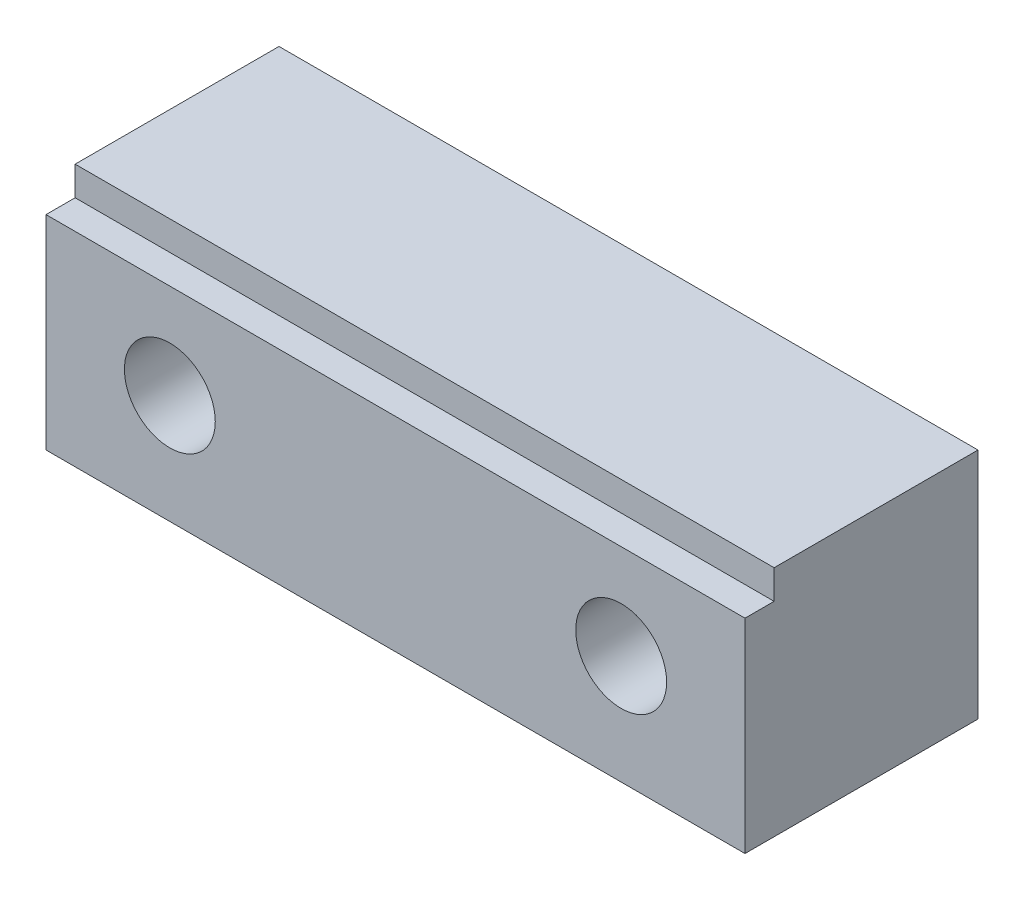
from build123d import *

# Parameters (mm, degrees)
SKETCH1_W           = 152.4
SKETCH1_H           = 50.8
BOSS_EXTRUDE1_DEPTH = 50.8
SKETCH2_R           = 9.906
CUT_EXTRUDE1_DEPTH  = 41.402
SKETCH3_R           = 6.7437
CUT_EXTRUDE2_DEPTH  = 105.726882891
SKETCH4_W           = 6.35
SKETCH4_H           = 6.35
CUT_EXTRUDE3_DEPTH  = 163.639355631


with BuildPart() as part:
    # Sketch1 → Boss-Extrude1 (new body)
    with BuildSketch(Plane(origin=(0, 0, 0), x_dir=(1, 0, 0), z_dir=(0, 1, 0))):
        Rectangle(SKETCH1_W, SKETCH1_H)
    extrude(amount=-BOSS_EXTRUDE1_DEPTH)

    # Sketch2 → Cut-Extrude1 (cut)
    with BuildSketch(Plane.XY.offset(25.4)):
        with Locations((-49.1998, -27.0002)):
            Circle(SKETCH2_R)
        with Locations((49.1998, -27.0002)):
            Circle(SKETCH2_R)
    extrude(amount=-CUT_EXTRUDE1_DEPTH, mode=Mode.SUBTRACT)

    # Sketch3 → Cut-Extrude2 (cut, through all)
    with BuildSketch(Plane.XY.offset(25.4)):
        with Locations((-49.1998, -27.0002)):
            Circle(SKETCH3_R)
        with Locations((49.1998, -27.0002)):
            Circle(SKETCH3_R)
    extrude(amount=-CUT_EXTRUDE2_DEPTH, mode=Mode.SUBTRACT)

    # Sketch4 → Cut-Extrude3 (cut, through all)
    with BuildSketch(Plane(origin=(76.2, 0, 0), x_dir=(0, 0, -1), z_dir=(1, 0, 0))):
        with Locations((-22.225, -3.175)):
            Rectangle(SKETCH4_W, SKETCH4_H)
    extrude(amount=-CUT_EXTRUDE3_DEPTH, mode=Mode.SUBTRACT)


solid = part.part
